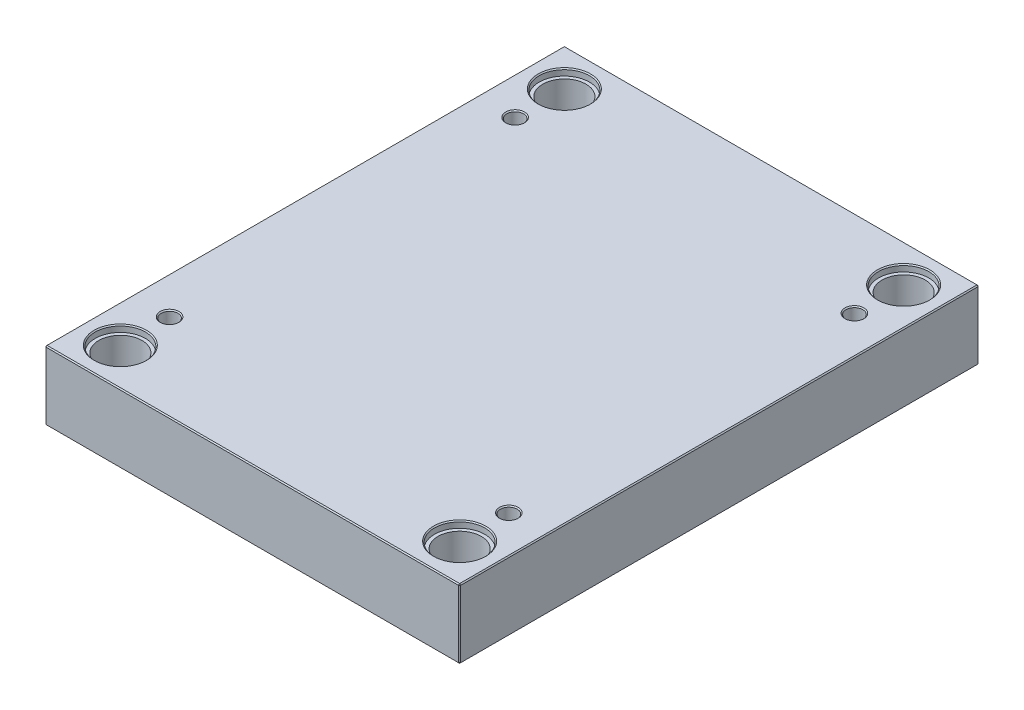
ISO-10303-21;
HEADER;
FILE_DESCRIPTION(('STEP AP214'),'2;1');
FILE_NAME('part.step','',(''),(''),'','','');
FILE_SCHEMA(('AUTOMOTIVE_DESIGN { 1 0 10303 214 1 1 1 1 }'));
ENDSEC;
DATA;
#1=APPLICATION_CONTEXT('core data for automotive mechanical design processes');
#2=APPLICATION_PROTOCOL_DEFINITION('international standard','automotive_design',2000,#1);
#3=PRODUCT_CONTEXT('',#1,'mechanical');
#4=PRODUCT('Part','Part','',(#3));
#5=PRODUCT_RELATED_PRODUCT_CATEGORY('part','',(#4));
#6=PRODUCT_DEFINITION_FORMATION('','',#4);
#7=PRODUCT_DEFINITION_CONTEXT('part definition',#1,'design');
#8=PRODUCT_DEFINITION('design','',#6,#7);
#9=PRODUCT_DEFINITION_SHAPE('','',#8);
#10=(LENGTH_UNIT() NAMED_UNIT(*) SI_UNIT(.MILLI.,.METRE.));
#11=(NAMED_UNIT(*) PLANE_ANGLE_UNIT() SI_UNIT($,.RADIAN.));
#12=(NAMED_UNIT(*) SI_UNIT($,.STERADIAN.) SOLID_ANGLE_UNIT());
#13=UNCERTAINTY_MEASURE_WITH_UNIT(LENGTH_MEASURE(1.E-05),#10,'distance_accuracy_value','');
#14=(GEOMETRIC_REPRESENTATION_CONTEXT(3) GLOBAL_UNCERTAINTY_ASSIGNED_CONTEXT((#13)) GLOBAL_UNIT_ASSIGNED_CONTEXT((#10,
#11,#12)) REPRESENTATION_CONTEXT('',''));
#15=CARTESIAN_POINT('',(0.,0.,0.));
#16=DIRECTION('',(0.,0.,1.));
#17=DIRECTION('',(1.,0.,0.));
#18=AXIS2_PLACEMENT_3D('',#15,#16,#17);
#19=CARTESIAN_POINT('',(-162.,0.,-212.));
#20=DIRECTION('',(0.,1.,0.));
#21=DIRECTION('',(0.,0.,1.));
#22=AXIS2_PLACEMENT_3D('',#19,#20,#21);
#23=CYLINDRICAL_SURFACE('',#22,20.65);
#24=CARTESIAN_POINT('',(-162.,0.999999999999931,-212.));
#25=DIRECTION('',(0.,1.,0.));
#26=DIRECTION('',(0.,0.,1.));
#27=AXIS2_PLACEMENT_3D('',#24,#25,#26);
#28=CIRCLE('',#27,20.65);
#29=CARTESIAN_POINT('',(-162.,0.999999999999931,-191.35));
#30=VERTEX_POINT('',#29);
#31=EDGE_CURVE('E471',#30,#30,#28,.F.);
#32=ORIENTED_EDGE('',*,*,#31,.T.);
#33=EDGE_LOOP('',(#32));
#34=FACE_BOUND('',#33,.T.);
#35=CARTESIAN_POINT('',(-162.,59.7,-212.));
#36=DIRECTION('',(0.,1.,0.));
#37=DIRECTION('',(0.,0.,1.));
#38=AXIS2_PLACEMENT_3D('',#35,#36,#37);
#39=CIRCLE('',#38,20.65);
#40=CARTESIAN_POINT('',(-162.,59.7,-191.35));
#41=VERTEX_POINT('',#40);
#42=EDGE_CURVE('E220',#41,#41,#39,.F.);
#43=ORIENTED_EDGE('',*,*,#42,.F.);
#44=EDGE_LOOP('',(#43));
#45=FACE_BOUND('',#44,.T.);
#46=ADVANCED_FACE('F15',(#34,#45),#23,.F.);
#47=CARTESIAN_POINT('',(162.,0.,-212.));
#48=DIRECTION('',(0.,1.,0.));
#49=DIRECTION('',(0.,0.,1.));
#50=AXIS2_PLACEMENT_3D('',#47,#48,#49);
#51=CYLINDRICAL_SURFACE('',#50,20.65);
#52=CARTESIAN_POINT('',(162.,0.999999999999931,-212.));
#53=DIRECTION('',(0.,1.,0.));
#54=DIRECTION('',(0.,0.,1.));
#55=AXIS2_PLACEMENT_3D('',#52,#53,#54);
#56=CIRCLE('',#55,20.65);
#57=CARTESIAN_POINT('',(162.,0.999999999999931,-191.35));
#58=VERTEX_POINT('',#57);
#59=EDGE_CURVE('E473',#58,#58,#56,.F.);
#60=ORIENTED_EDGE('',*,*,#59,.T.);
#61=EDGE_LOOP('',(#60));
#62=FACE_BOUND('',#61,.T.);
#63=CARTESIAN_POINT('',(162.,59.7,-212.));
#64=DIRECTION('',(0.,1.,0.));
#65=DIRECTION('',(0.,0.,1.));
#66=AXIS2_PLACEMENT_3D('',#63,#64,#65);
#67=CIRCLE('',#66,20.65);
#68=CARTESIAN_POINT('',(162.,59.7,-191.35));
#69=VERTEX_POINT('',#68);
#70=EDGE_CURVE('E217',#69,#69,#67,.F.);
#71=ORIENTED_EDGE('',*,*,#70,.F.);
#72=EDGE_LOOP('',(#71));
#73=FACE_BOUND('',#72,.T.);
#74=ADVANCED_FACE('F262',(#62,#73),#51,.F.);
#75=CARTESIAN_POINT('',(162.,0.,212.));
#76=DIRECTION('',(0.,1.,0.));
#77=DIRECTION('',(0.,0.,1.));
#78=AXIS2_PLACEMENT_3D('',#75,#76,#77);
#79=CYLINDRICAL_SURFACE('',#78,20.65);
#80=CARTESIAN_POINT('',(162.,1.0000000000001,212.));
#81=DIRECTION('',(0.,1.,0.));
#82=DIRECTION('',(0.,0.,1.));
#83=AXIS2_PLACEMENT_3D('',#80,#81,#82);
#84=CIRCLE('',#83,20.65);
#85=CARTESIAN_POINT('',(162.,1.0000000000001,232.65));
#86=VERTEX_POINT('',#85);
#87=EDGE_CURVE('E476',#86,#86,#84,.F.);
#88=ORIENTED_EDGE('',*,*,#87,.T.);
#89=EDGE_LOOP('',(#88));
#90=FACE_BOUND('',#89,.T.);
#91=CARTESIAN_POINT('',(162.,59.7,212.));
#92=DIRECTION('',(0.,1.,0.));
#93=DIRECTION('',(0.,0.,1.));
#94=AXIS2_PLACEMENT_3D('',#91,#92,#93);
#95=CIRCLE('',#94,20.65);
#96=CARTESIAN_POINT('',(162.,59.7,232.65));
#97=VERTEX_POINT('',#96);
#98=EDGE_CURVE('E213',#97,#97,#95,.F.);
#99=ORIENTED_EDGE('',*,*,#98,.F.);
#100=EDGE_LOOP('',(#99));
#101=FACE_BOUND('',#100,.T.);
#102=ADVANCED_FACE('F269',(#90,#101),#79,.F.);
#103=CARTESIAN_POINT('',(-162.,0.,212.));
#104=DIRECTION('',(0.,1.,0.));
#105=DIRECTION('',(0.,0.,1.));
#106=AXIS2_PLACEMENT_3D('',#103,#104,#105);
#107=CYLINDRICAL_SURFACE('',#106,20.65);
#108=CARTESIAN_POINT('',(-162.,0.999999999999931,212.));
#109=DIRECTION('',(0.,1.,0.));
#110=DIRECTION('',(0.,0.,1.));
#111=AXIS2_PLACEMENT_3D('',#108,#109,#110);
#112=CIRCLE('',#111,20.65);
#113=CARTESIAN_POINT('',(-162.,0.999999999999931,232.65));
#114=VERTEX_POINT('',#113);
#115=EDGE_CURVE('E479',#114,#114,#112,.F.);
#116=ORIENTED_EDGE('',*,*,#115,.T.);
#117=EDGE_LOOP('',(#116));
#118=FACE_BOUND('',#117,.T.);
#119=CARTESIAN_POINT('',(-162.,59.7,212.));
#120=DIRECTION('',(0.,1.,0.));
#121=DIRECTION('',(0.,0.,1.));
#122=AXIS2_PLACEMENT_3D('',#119,#120,#121);
#123=CIRCLE('',#122,20.65);
#124=CARTESIAN_POINT('',(-162.,59.7,232.65));
#125=VERTEX_POINT('',#124);
#126=EDGE_CURVE('E210',#125,#125,#123,.F.);
#127=ORIENTED_EDGE('',*,*,#126,.F.);
#128=EDGE_LOOP('',(#127));
#129=FACE_BOUND('',#128,.T.);
#130=ADVANCED_FACE('F276',(#118,#129),#107,.F.);
#131=CARTESIAN_POINT('',(-198.,66.,248.));
#132=DIRECTION('',(1.,0.,0.));
#133=DIRECTION('',(0.,0.,-1.));
#134=AXIS2_PLACEMENT_3D('',#131,#132,#133);
#135=PLANE('',#134);
#136=DIRECTION('',(0.,-1.,0.));
#137=VECTOR('',#136,1.);
#138=CARTESIAN_POINT('',(-198.,66.,-247.));
#139=LINE('',#138,#137);
#140=CARTESIAN_POINT('',(-198.,65.,-247.));
#141=VERTEX_POINT('',#140);
#142=CARTESIAN_POINT('',(-198.,1.00000000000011,-247.));
#143=VERTEX_POINT('',#142);
#144=EDGE_CURVE('E486',#141,#143,#139,.T.);
#145=ORIENTED_EDGE('',*,*,#144,.T.);
#146=DIRECTION('',(0.,0.,1.));
#147=VECTOR('',#146,1.);
#148=CARTESIAN_POINT('',(-198.,1.00000000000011,248.));
#149=LINE('',#148,#147);
#150=CARTESIAN_POINT('',(-198.,1.00000000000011,247.));
#151=VERTEX_POINT('',#150);
#152=EDGE_CURVE('E489',#143,#151,#149,.T.);
#153=ORIENTED_EDGE('',*,*,#152,.T.);
#154=DIRECTION('',(0.,1.,0.));
#155=VECTOR('',#154,1.);
#156=CARTESIAN_POINT('',(-198.,66.,247.));
#157=LINE('',#156,#155);
#158=CARTESIAN_POINT('',(-198.,65.,247.));
#159=VERTEX_POINT('',#158);
#160=EDGE_CURVE('E484',#151,#159,#157,.T.);
#161=ORIENTED_EDGE('',*,*,#160,.T.);
#162=DIRECTION('',(0.,0.,-1.));
#163=VECTOR('',#162,1.);
#164=CARTESIAN_POINT('',(-198.,65.,-248.));
#165=LINE('',#164,#163);
#166=EDGE_CURVE('E482',#159,#141,#165,.T.);
#167=ORIENTED_EDGE('',*,*,#166,.T.);
#168=EDGE_LOOP('',(#145,#153,#161,#167));
#169=FACE_BOUND('',#168,.T.);
#170=ADVANCED_FACE('F297',(#169),#135,.F.);
#171=CARTESIAN_POINT('',(198.,66.,248.));
#172=DIRECTION('',(0.,0.,-1.));
#173=DIRECTION('',(-1.,0.,0.));
#174=AXIS2_PLACEMENT_3D('',#171,#172,#173);
#175=PLANE('',#174);
#176=DIRECTION('',(-1.,0.,0.));
#177=VECTOR('',#176,1.);
#178=CARTESIAN_POINT('',(-198.,65.,248.));
#179=LINE('',#178,#177);
#180=CARTESIAN_POINT('',(197.,65.,248.));
#181=VERTEX_POINT('',#180);
#182=CARTESIAN_POINT('',(-197.,65.,248.));
#183=VERTEX_POINT('',#182);
#184=EDGE_CURVE('E508',#181,#183,#179,.T.);
#185=ORIENTED_EDGE('',*,*,#184,.T.);
#186=DIRECTION('',(0.,-1.,0.));
#187=VECTOR('',#186,1.);
#188=CARTESIAN_POINT('',(-197.,66.,248.));
#189=LINE('',#188,#187);
#190=CARTESIAN_POINT('',(-197.,1.00000000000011,248.));
#191=VERTEX_POINT('',#190);
#192=EDGE_CURVE('E514',#183,#191,#189,.T.);
#193=ORIENTED_EDGE('',*,*,#192,.T.);
#194=DIRECTION('',(1.,0.,0.));
#195=VECTOR('',#194,1.);
#196=CARTESIAN_POINT('',(198.,1.00000000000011,248.));
#197=LINE('',#196,#195);
#198=CARTESIAN_POINT('',(197.,1.00000000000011,248.));
#199=VERTEX_POINT('',#198);
#200=EDGE_CURVE('E512',#191,#199,#197,.T.);
#201=ORIENTED_EDGE('',*,*,#200,.T.);
#202=DIRECTION('',(0.,1.,0.));
#203=VECTOR('',#202,1.);
#204=CARTESIAN_POINT('',(197.,66.,248.));
#205=LINE('',#204,#203);
#206=EDGE_CURVE('E510',#199,#181,#205,.T.);
#207=ORIENTED_EDGE('',*,*,#206,.T.);
#208=EDGE_LOOP('',(#185,#193,#201,#207));
#209=FACE_BOUND('',#208,.T.);
#210=ADVANCED_FACE('F293',(#209),#175,.F.);
#211=CARTESIAN_POINT('',(198.,66.,248.));
#212=DIRECTION('',(-1.,0.,0.));
#213=DIRECTION('',(0.,0.,1.));
#214=AXIS2_PLACEMENT_3D('',#211,#212,#213);
#215=PLANE('',#214);
#216=DIRECTION('',(0.,0.,-1.));
#217=VECTOR('',#216,1.);
#218=CARTESIAN_POINT('',(198.,1.00000000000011,248.));
#219=LINE('',#218,#217);
#220=CARTESIAN_POINT('',(198.,1.00000000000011,247.));
#221=VERTEX_POINT('',#220);
#222=CARTESIAN_POINT('',(198.,1.00000000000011,-247.));
#223=VERTEX_POINT('',#222);
#224=EDGE_CURVE('E503',#221,#223,#219,.T.);
#225=ORIENTED_EDGE('',*,*,#224,.T.);
#226=DIRECTION('',(0.,1.,0.));
#227=VECTOR('',#226,1.);
#228=CARTESIAN_POINT('',(198.,66.,-247.));
#229=LINE('',#228,#227);
#230=CARTESIAN_POINT('',(198.,65.,-247.));
#231=VERTEX_POINT('',#230);
#232=EDGE_CURVE('E505',#223,#231,#229,.T.);
#233=ORIENTED_EDGE('',*,*,#232,.T.);
#234=DIRECTION('',(0.,0.,1.));
#235=VECTOR('',#234,1.);
#236=CARTESIAN_POINT('',(198.,65.,248.));
#237=LINE('',#236,#235);
#238=CARTESIAN_POINT('',(198.,65.,247.));
#239=VERTEX_POINT('',#238);
#240=EDGE_CURVE('E499',#231,#239,#237,.T.);
#241=ORIENTED_EDGE('',*,*,#240,.T.);
#242=DIRECTION('',(0.,-1.,0.));
#243=VECTOR('',#242,1.);
#244=CARTESIAN_POINT('',(198.,66.,247.));
#245=LINE('',#244,#243);
#246=EDGE_CURVE('E501',#239,#221,#245,.T.);
#247=ORIENTED_EDGE('',*,*,#246,.T.);
#248=EDGE_LOOP('',(#225,#233,#241,#247));
#249=FACE_BOUND('',#248,.T.);
#250=ADVANCED_FACE('F289',(#249),#215,.F.);
#251=CARTESIAN_POINT('',(198.,66.,-248.));
#252=DIRECTION('',(0.,0.,1.));
#253=DIRECTION('',(1.,0.,0.));
#254=AXIS2_PLACEMENT_3D('',#251,#252,#253);
#255=PLANE('',#254);
#256=DIRECTION('',(0.,-1.,0.));
#257=VECTOR('',#256,1.);
#258=CARTESIAN_POINT('',(197.,66.,-248.));
#259=LINE('',#258,#257);
#260=CARTESIAN_POINT('',(197.,65.,-248.));
#261=VERTEX_POINT('',#260);
#262=CARTESIAN_POINT('',(197.,1.00000000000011,-248.));
#263=VERTEX_POINT('',#262);
#264=EDGE_CURVE('E493',#261,#263,#259,.T.);
#265=ORIENTED_EDGE('',*,*,#264,.T.);
#266=DIRECTION('',(-1.,0.,0.));
#267=VECTOR('',#266,1.);
#268=CARTESIAN_POINT('',(198.,1.00000000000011,-248.));
#269=LINE('',#268,#267);
#270=CARTESIAN_POINT('',(-197.,1.00000000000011,-248.));
#271=VERTEX_POINT('',#270);
#272=EDGE_CURVE('E137',#263,#271,#269,.T.);
#273=ORIENTED_EDGE('',*,*,#272,.T.);
#274=DIRECTION('',(0.,1.,0.));
#275=VECTOR('',#274,1.);
#276=CARTESIAN_POINT('',(-197.,66.,-248.));
#277=LINE('',#276,#275);
#278=CARTESIAN_POINT('',(-197.,65.,-248.));
#279=VERTEX_POINT('',#278);
#280=EDGE_CURVE('E495',#271,#279,#277,.T.);
#281=ORIENTED_EDGE('',*,*,#280,.T.);
#282=DIRECTION('',(1.,0.,0.));
#283=VECTOR('',#282,1.);
#284=CARTESIAN_POINT('',(198.,65.,-248.));
#285=LINE('',#284,#283);
#286=EDGE_CURVE('E491',#279,#261,#285,.T.);
#287=ORIENTED_EDGE('',*,*,#286,.T.);
#288=EDGE_LOOP('',(#265,#273,#281,#287));
#289=FACE_BOUND('',#288,.T.);
#290=ADVANCED_FACE('F281',(#289),#255,.F.);
#291=CARTESIAN_POINT('',(0.,66.,0.));
#292=DIRECTION('',(0.,1.,0.));
#293=DIRECTION('',(0.,0.,1.));
#294=AXIS2_PLACEMENT_3D('',#291,#292,#293);
#295=PLANE('',#294);
#296=CARTESIAN_POINT('',(162.,66.,212.));
#297=DIRECTION('',(0.,1.,0.));
#298=DIRECTION('',(0.,0.,1.));
#299=AXIS2_PLACEMENT_3D('',#296,#297,#298);
#300=CIRCLE('',#299,25.);
#301=CARTESIAN_POINT('',(162.,66.,237.));
#302=VERTEX_POINT('',#301);
#303=EDGE_CURVE('E235',#302,#302,#300,.F.);
#304=ORIENTED_EDGE('',*,*,#303,.T.);
#305=EDGE_LOOP('',(#304));
#306=FACE_BOUND('',#305,.T.);
#307=CARTESIAN_POINT('',(-162.,66.,212.));
#308=DIRECTION('',(0.,1.,0.));
#309=DIRECTION('',(0.,0.,1.));
#310=AXIS2_PLACEMENT_3D('',#307,#308,#309);
#311=CIRCLE('',#310,25.);
#312=CARTESIAN_POINT('',(-162.,66.,237.));
#313=VERTEX_POINT('',#312);
#314=EDGE_CURVE('E232',#313,#313,#311,.F.);
#315=ORIENTED_EDGE('',*,*,#314,.T.);
#316=EDGE_LOOP('',(#315));
#317=FACE_BOUND('',#316,.T.);
#318=CARTESIAN_POINT('',(162.,66.,-212.));
#319=DIRECTION('',(0.,1.,0.));
#320=DIRECTION('',(0.,0.,1.));
#321=AXIS2_PLACEMENT_3D('',#318,#319,#320);
#322=CIRCLE('',#321,25.);
#323=CARTESIAN_POINT('',(162.,66.,-187.));
#324=VERTEX_POINT('',#323);
#325=EDGE_CURVE('E229',#324,#324,#322,.F.);
#326=ORIENTED_EDGE('',*,*,#325,.T.);
#327=EDGE_LOOP('',(#326));
#328=FACE_BOUND('',#327,.T.);
#329=CARTESIAN_POINT('',(-162.,66.,-212.));
#330=DIRECTION('',(0.,1.,0.));
#331=DIRECTION('',(0.,0.,1.));
#332=AXIS2_PLACEMENT_3D('',#329,#330,#331);
#333=CIRCLE('',#332,25.);
#334=CARTESIAN_POINT('',(-162.,66.,-187.));
#335=VERTEX_POINT('',#334);
#336=EDGE_CURVE('E226',#335,#335,#333,.F.);
#337=ORIENTED_EDGE('',*,*,#336,.T.);
#338=EDGE_LOOP('',(#337));
#339=FACE_BOUND('',#338,.T.);
#340=CARTESIAN_POINT('',(-162.,66.,165.));
#341=DIRECTION('',(0.,1.,0.));
#342=DIRECTION('',(0.,0.,1.));
#343=AXIS2_PLACEMENT_3D('',#340,#341,#342);
#344=CIRCLE('',#343,9.00000000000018);
#345=CARTESIAN_POINT('',(-162.,66.,174.));
#346=VERTEX_POINT('',#345);
#347=EDGE_CURVE('E197',#346,#346,#344,.F.);
#348=ORIENTED_EDGE('',*,*,#347,.T.);
#349=EDGE_LOOP('',(#348));
#350=FACE_BOUND('',#349,.T.);
#351=CARTESIAN_POINT('',(162.,66.,165.));
#352=DIRECTION('',(0.,1.,0.));
#353=DIRECTION('',(0.,0.,1.));
#354=AXIS2_PLACEMENT_3D('',#351,#352,#353);
#355=CIRCLE('',#354,9.);
#356=CARTESIAN_POINT('',(162.,66.,174.));
#357=VERTEX_POINT('',#356);
#358=EDGE_CURVE('E194',#357,#357,#355,.F.);
#359=ORIENTED_EDGE('',*,*,#358,.T.);
#360=EDGE_LOOP('',(#359));
#361=FACE_BOUND('',#360,.T.);
#362=CARTESIAN_POINT('',(162.,66.,-165.));
#363=DIRECTION('',(0.,1.,0.));
#364=DIRECTION('',(0.,0.,1.));
#365=AXIS2_PLACEMENT_3D('',#362,#363,#364);
#366=CIRCLE('',#365,9.00000000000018);
#367=CARTESIAN_POINT('',(162.,66.,-156.));
#368=VERTEX_POINT('',#367);
#369=EDGE_CURVE('E191',#368,#368,#366,.F.);
#370=ORIENTED_EDGE('',*,*,#369,.T.);
#371=EDGE_LOOP('',(#370));
#372=FACE_BOUND('',#371,.T.);
#373=CARTESIAN_POINT('',(-162.,66.,-165.));
#374=DIRECTION('',(0.,1.,0.));
#375=DIRECTION('',(0.,0.,1.));
#376=AXIS2_PLACEMENT_3D('',#373,#374,#375);
#377=CIRCLE('',#376,9.);
#378=CARTESIAN_POINT('',(-162.,66.,-156.));
#379=VERTEX_POINT('',#378);
#380=EDGE_CURVE('E187',#379,#379,#377,.F.);
#381=ORIENTED_EDGE('',*,*,#380,.T.);
#382=EDGE_LOOP('',(#381));
#383=FACE_BOUND('',#382,.T.);
#384=DIRECTION('',(0.,0.,-1.));
#385=VECTOR('',#384,1.);
#386=CARTESIAN_POINT('',(197.,66.,-248.));
#387=LINE('',#386,#385);
#388=CARTESIAN_POINT('',(197.,66.,247.));
#389=VERTEX_POINT('',#388);
#390=CARTESIAN_POINT('',(197.,66.,-247.));
#391=VERTEX_POINT('',#390);
#392=EDGE_CURVE('E30',#389,#391,#387,.T.);
#393=ORIENTED_EDGE('',*,*,#392,.T.);
#394=DIRECTION('',(-1.,0.,0.));
#395=VECTOR('',#394,1.);
#396=CARTESIAN_POINT('',(-198.,66.,-247.));
#397=LINE('',#396,#395);
#398=CARTESIAN_POINT('',(-197.,66.,-247.));
#399=VERTEX_POINT('',#398);
#400=EDGE_CURVE('E188',#391,#399,#397,.T.);
#401=ORIENTED_EDGE('',*,*,#400,.T.);
#402=DIRECTION('',(0.,0.,1.));
#403=VECTOR('',#402,1.);
#404=CARTESIAN_POINT('',(-197.,66.,248.));
#405=LINE('',#404,#403);
#406=CARTESIAN_POINT('',(-197.,66.,247.));
#407=VERTEX_POINT('',#406);
#408=EDGE_CURVE('E517',#399,#407,#405,.T.);
#409=ORIENTED_EDGE('',*,*,#408,.T.);
#410=DIRECTION('',(1.,0.,0.));
#411=VECTOR('',#410,1.);
#412=CARTESIAN_POINT('',(198.,66.,247.));
#413=LINE('',#412,#411);
#414=EDGE_CURVE('E35',#407,#389,#413,.T.);
#415=ORIENTED_EDGE('',*,*,#414,.T.);
#416=EDGE_LOOP('',(#393,#401,#409,#415));
#417=FACE_BOUND('',#416,.T.);
#418=ADVANCED_FACE('F278',(#306,#317,#328,#339,#350,#361,#372,#383,#417),#295,.T.);
#419=CARTESIAN_POINT('',(0.,0.,0.));
#420=DIRECTION('',(0.,1.,0.));
#421=DIRECTION('',(0.,0.,1.));
#422=AXIS2_PLACEMENT_3D('',#419,#420,#421);
#423=PLANE('',#422);
#424=CARTESIAN_POINT('',(-162.,0.,-212.));
#425=DIRECTION('',(0.,1.,0.));
#426=DIRECTION('',(0.,0.,1.));
#427=AXIS2_PLACEMENT_3D('',#424,#425,#426);
#428=CIRCLE('',#427,21.65);
#429=CARTESIAN_POINT('',(-162.,0.,-190.35));
#430=VERTEX_POINT('',#429);
#431=EDGE_CURVE('E468',#430,#430,#428,.T.);
#432=ORIENTED_EDGE('',*,*,#431,.T.);
#433=EDGE_LOOP('',(#432));
#434=FACE_BOUND('',#433,.T.);
#435=CARTESIAN_POINT('',(162.,0.,-212.));
#436=DIRECTION('',(0.,1.,0.));
#437=DIRECTION('',(0.,0.,1.));
#438=AXIS2_PLACEMENT_3D('',#435,#436,#437);
#439=CIRCLE('',#438,21.65);
#440=CARTESIAN_POINT('',(162.,0.,-190.35));
#441=VERTEX_POINT('',#440);
#442=EDGE_CURVE('E465',#441,#441,#439,.T.);
#443=ORIENTED_EDGE('',*,*,#442,.T.);
#444=EDGE_LOOP('',(#443));
#445=FACE_BOUND('',#444,.T.);
#446=CARTESIAN_POINT('',(162.,0.,212.));
#447=DIRECTION('',(0.,1.,0.));
#448=DIRECTION('',(0.,0.,1.));
#449=AXIS2_PLACEMENT_3D('',#446,#447,#448);
#450=CIRCLE('',#449,21.65);
#451=CARTESIAN_POINT('',(162.,0.,233.65));
#452=VERTEX_POINT('',#451);
#453=EDGE_CURVE('E462',#452,#452,#450,.T.);
#454=ORIENTED_EDGE('',*,*,#453,.T.);
#455=EDGE_LOOP('',(#454));
#456=FACE_BOUND('',#455,.T.);
#457=CARTESIAN_POINT('',(-162.,0.,212.));
#458=DIRECTION('',(0.,1.,0.));
#459=DIRECTION('',(0.,0.,1.));
#460=AXIS2_PLACEMENT_3D('',#457,#458,#459);
#461=CIRCLE('',#460,21.65);
#462=CARTESIAN_POINT('',(-162.,0.,233.65));
#463=VERTEX_POINT('',#462);
#464=EDGE_CURVE('E459',#463,#463,#461,.T.);
#465=ORIENTED_EDGE('',*,*,#464,.T.);
#466=EDGE_LOOP('',(#465));
#467=FACE_BOUND('',#466,.T.);
#468=DIRECTION('',(0.,0.,1.));
#469=VECTOR('',#468,1.);
#470=CARTESIAN_POINT('',(197.,0.,0.));
#471=LINE('',#470,#469);
#472=CARTESIAN_POINT('',(197.,0.,-247.));
#473=VERTEX_POINT('',#472);
#474=CARTESIAN_POINT('',(197.,0.,247.));
#475=VERTEX_POINT('',#474);
#476=EDGE_CURVE('E107',#473,#475,#471,.T.);
#477=ORIENTED_EDGE('',*,*,#476,.T.);
#478=DIRECTION('',(-1.,0.,0.));
#479=VECTOR('',#478,1.);
#480=CARTESIAN_POINT('',(0.,0.,247.));
#481=LINE('',#480,#479);
#482=CARTESIAN_POINT('',(-197.,0.,247.));
#483=VERTEX_POINT('',#482);
#484=EDGE_CURVE('E457',#475,#483,#481,.T.);
#485=ORIENTED_EDGE('',*,*,#484,.T.);
#486=DIRECTION('',(0.,0.,-1.));
#487=VECTOR('',#486,1.);
#488=CARTESIAN_POINT('',(-197.,0.,0.));
#489=LINE('',#488,#487);
#490=CARTESIAN_POINT('',(-197.,0.,-247.));
#491=VERTEX_POINT('',#490);
#492=EDGE_CURVE('E109',#483,#491,#489,.T.);
#493=ORIENTED_EDGE('',*,*,#492,.T.);
#494=DIRECTION('',(1.,0.,0.));
#495=VECTOR('',#494,1.);
#496=CARTESIAN_POINT('',(0.,0.,-247.));
#497=LINE('',#496,#495);
#498=EDGE_CURVE('E103',#491,#473,#497,.T.);
#499=ORIENTED_EDGE('',*,*,#498,.T.);
#500=EDGE_LOOP('',(#477,#485,#493,#499));
#501=FACE_BOUND('',#500,.T.);
#502=ADVANCED_FACE('F105',(#434,#445,#456,#467,#501),#423,.F.);
#503=CARTESIAN_POINT('',(-162.,0.,-212.));
#504=DIRECTION('',(0.,-1.,0.));
#505=DIRECTION('',(0.,0.,-1.));
#506=AXIS2_PLACEMENT_3D('',#503,#504,#505);
#507=CONICAL_SURFACE('',#506,21.65,0.785398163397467);
#508=ORIENTED_EDGE('',*,*,#31,.F.);
#509=EDGE_LOOP('',(#508));
#510=FACE_BOUND('',#509,.T.);
#511=ORIENTED_EDGE('',*,*,#431,.F.);
#512=EDGE_LOOP('',(#511));
#513=FACE_BOUND('',#512,.T.);
#514=ADVANCED_FACE('F285',(#510,#513),#507,.F.);
#515=CARTESIAN_POINT('',(162.,0.,-212.));
#516=DIRECTION('',(0.,-1.,0.));
#517=DIRECTION('',(0.,0.,-1.));
#518=AXIS2_PLACEMENT_3D('',#515,#516,#517);
#519=CONICAL_SURFACE('',#518,21.65,0.785398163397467);
#520=ORIENTED_EDGE('',*,*,#59,.F.);
#521=EDGE_LOOP('',(#520));
#522=FACE_BOUND('',#521,.T.);
#523=ORIENTED_EDGE('',*,*,#442,.F.);
#524=EDGE_LOOP('',(#523));
#525=FACE_BOUND('',#524,.T.);
#526=ADVANCED_FACE('F304',(#522,#525),#519,.F.);
#527=CARTESIAN_POINT('',(162.,0.,212.));
#528=DIRECTION('',(0.,-1.,0.));
#529=DIRECTION('',(0.,0.,-1.));
#530=AXIS2_PLACEMENT_3D('',#527,#528,#529);
#531=CONICAL_SURFACE('',#530,21.65,0.785398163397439);
#532=ORIENTED_EDGE('',*,*,#87,.F.);
#533=EDGE_LOOP('',(#532));
#534=FACE_BOUND('',#533,.T.);
#535=ORIENTED_EDGE('',*,*,#453,.F.);
#536=EDGE_LOOP('',(#535));
#537=FACE_BOUND('',#536,.T.);
#538=ADVANCED_FACE('F308',(#534,#537),#531,.F.);
#539=CARTESIAN_POINT('',(-162.,0.,212.));
#540=DIRECTION('',(0.,-1.,0.));
#541=DIRECTION('',(0.,0.,-1.));
#542=AXIS2_PLACEMENT_3D('',#539,#540,#541);
#543=CONICAL_SURFACE('',#542,21.65,0.785398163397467);
#544=ORIENTED_EDGE('',*,*,#115,.F.);
#545=EDGE_LOOP('',(#544));
#546=FACE_BOUND('',#545,.T.);
#547=ORIENTED_EDGE('',*,*,#464,.F.);
#548=EDGE_LOOP('',(#547));
#549=FACE_BOUND('',#548,.T.);
#550=ADVANCED_FACE('F312',(#546,#549),#543,.F.);
#551=CARTESIAN_POINT('',(198.,66.,247.));
#552=DIRECTION('',(-0.707106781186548,0.,-0.707106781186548));
#553=DIRECTION('',(0.,-1.,0.));
#554=AXIS2_PLACEMENT_3D('',#551,#552,#553);
#555=PLANE('',#554);
#556=DIRECTION('',(-0.707106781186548,0.,0.707106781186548));
#557=VECTOR('',#556,1.);
#558=CARTESIAN_POINT('',(197.,65.,248.));
#559=LINE('',#558,#557);
#560=EDGE_CURVE('E125',#181,#239,#559,.F.);
#561=ORIENTED_EDGE('',*,*,#560,.F.);
#562=ORIENTED_EDGE('',*,*,#206,.F.);
#563=DIRECTION('',(0.707106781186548,0.,-0.707106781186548));
#564=VECTOR('',#563,1.);
#565=CARTESIAN_POINT('',(197.,1.00000000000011,248.));
#566=LINE('',#565,#564);
#567=EDGE_CURVE('E179',#221,#199,#566,.F.);
#568=ORIENTED_EDGE('',*,*,#567,.F.);
#569=ORIENTED_EDGE('',*,*,#246,.F.);
#570=EDGE_LOOP('',(#561,#562,#568,#569));
#571=FACE_BOUND('',#570,.T.);
#572=ADVANCED_FACE('F316',(#571),#555,.F.);
#573=CARTESIAN_POINT('',(197.,65.,248.));
#574=DIRECTION('',(0.577350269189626,0.577350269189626,0.577350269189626));
#575=DIRECTION('',(0.707106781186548,0.,-0.707106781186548));
#576=AXIS2_PLACEMENT_3D('',#573,#574,#575);
#577=PLANE('',#576);
#578=DIRECTION('',(0.,-0.707106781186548,0.707106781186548));
#579=VECTOR('',#578,1.);
#580=CARTESIAN_POINT('',(197.,65.,248.));
#581=LINE('',#580,#579);
#582=EDGE_CURVE('E174',#181,#389,#581,.F.);
#583=ORIENTED_EDGE('',*,*,#582,.F.);
#584=ORIENTED_EDGE('',*,*,#560,.T.);
#585=DIRECTION('',(-0.707106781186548,0.707106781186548,0.));
#586=VECTOR('',#585,1.);
#587=CARTESIAN_POINT('',(197.5,65.5,247.));
#588=LINE('',#587,#586);
#589=EDGE_CURVE('E176',#389,#239,#588,.F.);
#590=ORIENTED_EDGE('',*,*,#589,.F.);
#591=EDGE_LOOP('',(#583,#584,#590));
#592=FACE_BOUND('',#591,.T.);
#593=ADVANCED_FACE('F384',(#592),#577,.T.);
#594=CARTESIAN_POINT('',(197.,1.00000000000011,248.));
#595=DIRECTION('',(0.577350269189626,-0.577350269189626,0.577350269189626));
#596=DIRECTION('',(0.707106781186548,0.,-0.707106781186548));
#597=AXIS2_PLACEMENT_3D('',#594,#595,#596);
#598=PLANE('',#597);
#599=DIRECTION('',(-0.707106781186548,-0.707106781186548,0.));
#600=VECTOR('',#599,1.);
#601=CARTESIAN_POINT('',(197.5,0.500000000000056,247.));
#602=LINE('',#601,#600);
#603=EDGE_CURVE('E123',#221,#475,#602,.T.);
#604=ORIENTED_EDGE('',*,*,#603,.F.);
#605=ORIENTED_EDGE('',*,*,#567,.T.);
#606=DIRECTION('',(0.,0.707106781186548,0.707106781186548));
#607=VECTOR('',#606,1.);
#608=CARTESIAN_POINT('',(197.,1.00000000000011,248.));
#609=LINE('',#608,#607);
#610=EDGE_CURVE('E171',#475,#199,#609,.T.);
#611=ORIENTED_EDGE('',*,*,#610,.F.);
#612=EDGE_LOOP('',(#604,#605,#611));
#613=FACE_BOUND('',#612,.T.);
#614=ADVANCED_FACE('F380',(#613),#598,.T.);
#615=CARTESIAN_POINT('',(197.,66.,0.));
#616=DIRECTION('',(0.707106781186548,0.707106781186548,0.));
#617=DIRECTION('',(0.,0.,1.));
#618=AXIS2_PLACEMENT_3D('',#615,#616,#617);
#619=PLANE('',#618);
#620=ORIENTED_EDGE('',*,*,#589,.T.);
#621=ORIENTED_EDGE('',*,*,#240,.F.);
#622=DIRECTION('',(0.707106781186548,-0.707106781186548,0.));
#623=VECTOR('',#622,1.);
#624=CARTESIAN_POINT('',(198.,65.,-247.));
#625=LINE('',#624,#623);
#626=EDGE_CURVE('E165',#391,#231,#625,.T.);
#627=ORIENTED_EDGE('',*,*,#626,.F.);
#628=ORIENTED_EDGE('',*,*,#392,.F.);
#629=EDGE_LOOP('',(#620,#621,#627,#628));
#630=FACE_BOUND('',#629,.T.);
#631=ADVANCED_FACE('F376',(#630),#619,.T.);
#632=CARTESIAN_POINT('',(0.,66.,247.));
#633=DIRECTION('',(0.,0.707106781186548,0.707106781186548));
#634=DIRECTION('',(-1.,0.,0.));
#635=AXIS2_PLACEMENT_3D('',#632,#633,#634);
#636=PLANE('',#635);
#637=ORIENTED_EDGE('',*,*,#582,.T.);
#638=ORIENTED_EDGE('',*,*,#414,.F.);
#639=DIRECTION('',(0.,0.707106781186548,-0.707106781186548));
#640=VECTOR('',#639,1.);
#641=CARTESIAN_POINT('',(-197.,65.5,247.5));
#642=LINE('',#641,#640);
#643=EDGE_CURVE('E162',#183,#407,#642,.T.);
#644=ORIENTED_EDGE('',*,*,#643,.F.);
#645=ORIENTED_EDGE('',*,*,#184,.F.);
#646=EDGE_LOOP('',(#637,#638,#644,#645));
#647=FACE_BOUND('',#646,.T.);
#648=ADVANCED_FACE('F372',(#647),#636,.T.);
#649=CARTESIAN_POINT('',(-197.,66.,248.));
#650=DIRECTION('',(0.707106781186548,0.,-0.707106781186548));
#651=DIRECTION('',(0.,-1.,0.));
#652=AXIS2_PLACEMENT_3D('',#649,#650,#651);
#653=PLANE('',#652);
#654=DIRECTION('',(0.707106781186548,0.,0.707106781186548));
#655=VECTOR('',#654,1.);
#656=CARTESIAN_POINT('',(-197.,1.00000000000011,248.));
#657=LINE('',#656,#655);
#658=EDGE_CURVE('E156',#191,#151,#657,.F.);
#659=ORIENTED_EDGE('',*,*,#658,.F.);
#660=ORIENTED_EDGE('',*,*,#192,.F.);
#661=DIRECTION('',(-0.707106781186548,0.,-0.707106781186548));
#662=VECTOR('',#661,1.);
#663=CARTESIAN_POINT('',(-198.,65.,247.));
#664=LINE('',#663,#662);
#665=EDGE_CURVE('E159',#159,#183,#664,.F.);
#666=ORIENTED_EDGE('',*,*,#665,.F.);
#667=ORIENTED_EDGE('',*,*,#160,.F.);
#668=EDGE_LOOP('',(#659,#660,#666,#667));
#669=FACE_BOUND('',#668,.T.);
#670=ADVANCED_FACE('F368',(#669),#653,.F.);
#671=CARTESIAN_POINT('',(198.,1.00000000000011,248.));
#672=DIRECTION('',(0.,0.707106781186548,-0.707106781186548));
#673=DIRECTION('',(1.,0.,0.));
#674=AXIS2_PLACEMENT_3D('',#671,#672,#673);
#675=PLANE('',#674);
#676=ORIENTED_EDGE('',*,*,#610,.T.);
#677=ORIENTED_EDGE('',*,*,#200,.F.);
#678=DIRECTION('',(0.,-0.707106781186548,-0.707106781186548));
#679=VECTOR('',#678,1.);
#680=CARTESIAN_POINT('',(-197.,1.00000000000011,248.));
#681=LINE('',#680,#679);
#682=EDGE_CURVE('E134',#483,#191,#681,.F.);
#683=ORIENTED_EDGE('',*,*,#682,.F.);
#684=ORIENTED_EDGE('',*,*,#484,.F.);
#685=EDGE_LOOP('',(#676,#677,#683,#684));
#686=FACE_BOUND('',#685,.T.);
#687=ADVANCED_FACE('F365',(#686),#675,.F.);
#688=CARTESIAN_POINT('',(198.,1.00000000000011,248.));
#689=DIRECTION('',(-0.707106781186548,0.707106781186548,0.));
#690=DIRECTION('',(0.,0.,-1.));
#691=AXIS2_PLACEMENT_3D('',#688,#689,#690);
#692=PLANE('',#691);
#693=ORIENTED_EDGE('',*,*,#603,.T.);
#694=ORIENTED_EDGE('',*,*,#476,.F.);
#695=DIRECTION('',(0.707106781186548,0.707106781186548,0.));
#696=VECTOR('',#695,1.);
#697=CARTESIAN_POINT('',(197.5,0.50000000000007,-247.));
#698=LINE('',#697,#696);
#699=EDGE_CURVE('E120',#223,#473,#698,.F.);
#700=ORIENTED_EDGE('',*,*,#699,.F.);
#701=ORIENTED_EDGE('',*,*,#224,.F.);
#702=EDGE_LOOP('',(#693,#694,#700,#701));
#703=FACE_BOUND('',#702,.T.);
#704=ADVANCED_FACE('F118',(#703),#692,.F.);
#705=CARTESIAN_POINT('',(197.,66.,-248.));
#706=DIRECTION('',(-0.707106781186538,0.,0.707106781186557));
#707=DIRECTION('',(0.,-1.,0.));
#708=AXIS2_PLACEMENT_3D('',#705,#706,#707);
#709=PLANE('',#708);
#710=DIRECTION('',(0.707106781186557,0.,0.707106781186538));
#711=VECTOR('',#710,1.);
#712=CARTESIAN_POINT('',(198.,65.,-247.));
#713=LINE('',#712,#711);
#714=EDGE_CURVE('E167',#231,#261,#713,.F.);
#715=ORIENTED_EDGE('',*,*,#714,.F.);
#716=ORIENTED_EDGE('',*,*,#232,.F.);
#717=DIRECTION('',(-0.707106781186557,0.,-0.707106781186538));
#718=VECTOR('',#717,1.);
#719=CARTESIAN_POINT('',(197.,1.00000000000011,-248.));
#720=LINE('',#719,#718);
#721=EDGE_CURVE('E133',#263,#223,#720,.F.);
#722=ORIENTED_EDGE('',*,*,#721,.F.);
#723=ORIENTED_EDGE('',*,*,#264,.F.);
#724=EDGE_LOOP('',(#715,#716,#722,#723));
#725=FACE_BOUND('',#724,.T.);
#726=ADVANCED_FACE('F358',(#725),#709,.F.);
#727=CARTESIAN_POINT('',(198.,65.,-247.));
#728=DIRECTION('',(0.577350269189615,0.577350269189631,-0.577350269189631));
#729=DIRECTION('',(0.,0.707106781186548,0.707106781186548));
#730=AXIS2_PLACEMENT_3D('',#727,#728,#729);
#731=PLANE('',#730);
#732=ORIENTED_EDGE('',*,*,#626,.T.);
#733=ORIENTED_EDGE('',*,*,#714,.T.);
#734=DIRECTION('',(0.,0.707106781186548,0.707106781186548));
#735=VECTOR('',#734,1.);
#736=CARTESIAN_POINT('',(197.,65.5,-247.5));
#737=LINE('',#736,#735);
#738=EDGE_CURVE('E151',#391,#261,#737,.F.);
#739=ORIENTED_EDGE('',*,*,#738,.F.);
#740=EDGE_LOOP('',(#732,#733,#739));
#741=FACE_BOUND('',#740,.T.);
#742=ADVANCED_FACE('F354',(#741),#731,.T.);
#743=CARTESIAN_POINT('',(-198.,65.,247.));
#744=DIRECTION('',(-0.577350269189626,0.577350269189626,0.577350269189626));
#745=DIRECTION('',(0.707106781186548,0.,0.707106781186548));
#746=AXIS2_PLACEMENT_3D('',#743,#744,#745);
#747=PLANE('',#746);
#748=ORIENTED_EDGE('',*,*,#665,.T.);
#749=ORIENTED_EDGE('',*,*,#643,.T.);
#750=DIRECTION('',(-0.707106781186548,-0.707106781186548,0.));
#751=VECTOR('',#750,1.);
#752=CARTESIAN_POINT('',(-198.,65.,247.));
#753=LINE('',#752,#751);
#754=EDGE_CURVE('E142',#159,#407,#753,.F.);
#755=ORIENTED_EDGE('',*,*,#754,.F.);
#756=EDGE_LOOP('',(#748,#749,#755));
#757=FACE_BOUND('',#756,.T.);
#758=ADVANCED_FACE('F350',(#757),#747,.T.);
#759=CARTESIAN_POINT('',(-197.,1.00000000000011,248.));
#760=DIRECTION('',(-0.577350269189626,-0.577350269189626,0.577350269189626));
#761=DIRECTION('',(0.707106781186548,0.,0.707106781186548));
#762=AXIS2_PLACEMENT_3D('',#759,#760,#761);
#763=PLANE('',#762);
#764=ORIENTED_EDGE('',*,*,#682,.T.);
#765=ORIENTED_EDGE('',*,*,#658,.T.);
#766=DIRECTION('',(-0.707106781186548,0.707106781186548,0.));
#767=VECTOR('',#766,1.);
#768=CARTESIAN_POINT('',(-197.5,0.500000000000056,247.));
#769=LINE('',#768,#767);
#770=EDGE_CURVE('E138',#483,#151,#769,.T.);
#771=ORIENTED_EDGE('',*,*,#770,.F.);
#772=EDGE_LOOP('',(#764,#765,#771));
#773=FACE_BOUND('',#772,.T.);
#774=ADVANCED_FACE('F347',(#773),#763,.T.);
#775=CARTESIAN_POINT('',(197.,1.00000000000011,-248.));
#776=DIRECTION('',(0.577350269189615,-0.577350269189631,-0.577350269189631));
#777=DIRECTION('',(0.,0.707106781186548,-0.707106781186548));
#778=AXIS2_PLACEMENT_3D('',#775,#776,#777);
#779=PLANE('',#778);
#780=ORIENTED_EDGE('',*,*,#721,.T.);
#781=ORIENTED_EDGE('',*,*,#699,.T.);
#782=DIRECTION('',(0.,-0.707106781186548,0.707106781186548));
#783=VECTOR('',#782,1.);
#784=CARTESIAN_POINT('',(197.,1.00000000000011,-248.));
#785=LINE('',#784,#783);
#786=EDGE_CURVE('E130',#263,#473,#785,.T.);
#787=ORIENTED_EDGE('',*,*,#786,.F.);
#788=EDGE_LOOP('',(#780,#781,#787));
#789=FACE_BOUND('',#788,.T.);
#790=ADVANCED_FACE('F129',(#789),#779,.T.);
#791=CARTESIAN_POINT('',(0.,66.,-247.));
#792=DIRECTION('',(0.,0.707106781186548,-0.707106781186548));
#793=DIRECTION('',(1.,0.,0.));
#794=AXIS2_PLACEMENT_3D('',#791,#792,#793);
#795=PLANE('',#794);
#796=ORIENTED_EDGE('',*,*,#738,.T.);
#797=ORIENTED_EDGE('',*,*,#286,.F.);
#798=DIRECTION('',(0.,-0.707106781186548,-0.707106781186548));
#799=VECTOR('',#798,1.);
#800=CARTESIAN_POINT('',(-197.,65.,-248.));
#801=LINE('',#800,#799);
#802=EDGE_CURVE('E139',#399,#279,#801,.T.);
#803=ORIENTED_EDGE('',*,*,#802,.F.);
#804=ORIENTED_EDGE('',*,*,#400,.F.);
#805=EDGE_LOOP('',(#796,#797,#803,#804));
#806=FACE_BOUND('',#805,.T.);
#807=ADVANCED_FACE('F340',(#806),#795,.T.);
#808=CARTESIAN_POINT('',(-197.,66.,0.));
#809=DIRECTION('',(-0.707106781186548,0.707106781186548,0.));
#810=DIRECTION('',(0.,0.,-1.));
#811=AXIS2_PLACEMENT_3D('',#808,#809,#810);
#812=PLANE('',#811);
#813=ORIENTED_EDGE('',*,*,#754,.T.);
#814=ORIENTED_EDGE('',*,*,#408,.F.);
#815=DIRECTION('',(0.707106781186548,0.707106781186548,0.));
#816=VECTOR('',#815,1.);
#817=CARTESIAN_POINT('',(-197.5,65.5,-247.));
#818=LINE('',#817,#816);
#819=EDGE_CURVE('E145',#141,#399,#818,.T.);
#820=ORIENTED_EDGE('',*,*,#819,.F.);
#821=ORIENTED_EDGE('',*,*,#166,.F.);
#822=EDGE_LOOP('',(#813,#814,#820,#821));
#823=FACE_BOUND('',#822,.T.);
#824=ADVANCED_FACE('F336',(#823),#812,.T.);
#825=CARTESIAN_POINT('',(-198.,1.00000000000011,248.));
#826=DIRECTION('',(0.707106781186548,0.707106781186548,0.));
#827=DIRECTION('',(0.,0.,1.));
#828=AXIS2_PLACEMENT_3D('',#825,#826,#827);
#829=PLANE('',#828);
#830=ORIENTED_EDGE('',*,*,#770,.T.);
#831=ORIENTED_EDGE('',*,*,#152,.F.);
#832=DIRECTION('',(0.707106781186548,-0.707106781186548,0.));
#833=VECTOR('',#832,1.);
#834=CARTESIAN_POINT('',(-198.,1.00000000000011,-247.));
#835=LINE('',#834,#833);
#836=EDGE_CURVE('E528',#491,#143,#835,.F.);
#837=ORIENTED_EDGE('',*,*,#836,.F.);
#838=ORIENTED_EDGE('',*,*,#492,.F.);
#839=EDGE_LOOP('',(#830,#831,#837,#838));
#840=FACE_BOUND('',#839,.T.);
#841=ADVANCED_FACE('F333',(#840),#829,.F.);
#842=CARTESIAN_POINT('',(198.,1.00000000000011,-248.));
#843=DIRECTION('',(0.,0.707106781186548,0.707106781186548));
#844=DIRECTION('',(-1.,0.,0.));
#845=AXIS2_PLACEMENT_3D('',#842,#843,#844);
#846=PLANE('',#845);
#847=ORIENTED_EDGE('',*,*,#786,.T.);
#848=ORIENTED_EDGE('',*,*,#498,.F.);
#849=DIRECTION('',(0.,0.707106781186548,-0.707106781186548));
#850=VECTOR('',#849,1.);
#851=CARTESIAN_POINT('',(-197.,0.500000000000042,-247.5));
#852=LINE('',#851,#850);
#853=EDGE_CURVE('E525',#271,#491,#852,.F.);
#854=ORIENTED_EDGE('',*,*,#853,.F.);
#855=ORIENTED_EDGE('',*,*,#272,.F.);
#856=EDGE_LOOP('',(#847,#848,#854,#855));
#857=FACE_BOUND('',#856,.T.);
#858=ADVANCED_FACE('F136',(#857),#846,.F.);
#859=CARTESIAN_POINT('',(-197.,65.,-248.));
#860=DIRECTION('',(-0.577350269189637,0.577350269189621,-0.577350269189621));
#861=DIRECTION('',(-0.707106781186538,0.,0.707106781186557));
#862=AXIS2_PLACEMENT_3D('',#859,#860,#861);
#863=PLANE('',#862);
#864=ORIENTED_EDGE('',*,*,#819,.T.);
#865=ORIENTED_EDGE('',*,*,#802,.T.);
#866=DIRECTION('',(0.707106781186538,0.,-0.707106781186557));
#867=VECTOR('',#866,1.);
#868=CARTESIAN_POINT('',(-197.,65.,-248.));
#869=LINE('',#868,#867);
#870=EDGE_CURVE('E523',#141,#279,#869,.T.);
#871=ORIENTED_EDGE('',*,*,#870,.F.);
#872=EDGE_LOOP('',(#864,#865,#871));
#873=FACE_BOUND('',#872,.T.);
#874=ADVANCED_FACE('F326',(#873),#863,.T.);
#875=CARTESIAN_POINT('',(-198.,1.00000000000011,-247.));
#876=DIRECTION('',(-0.577350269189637,-0.577350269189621,-0.577350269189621));
#877=DIRECTION('',(-0.707106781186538,0.,0.707106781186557));
#878=AXIS2_PLACEMENT_3D('',#875,#876,#877);
#879=PLANE('',#878);
#880=ORIENTED_EDGE('',*,*,#853,.T.);
#881=ORIENTED_EDGE('',*,*,#836,.T.);
#882=DIRECTION('',(-0.707106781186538,0.,0.707106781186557));
#883=VECTOR('',#882,1.);
#884=CARTESIAN_POINT('',(-198.,1.00000000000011,-247.));
#885=LINE('',#884,#883);
#886=EDGE_CURVE('E454',#271,#143,#885,.T.);
#887=ORIENTED_EDGE('',*,*,#886,.F.);
#888=EDGE_LOOP('',(#880,#881,#887));
#889=FACE_BOUND('',#888,.T.);
#890=ADVANCED_FACE('F322',(#889),#879,.T.);
#891=CARTESIAN_POINT('',(-198.,66.,-247.));
#892=DIRECTION('',(0.707106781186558,0.,0.707106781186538));
#893=DIRECTION('',(0.,-1.,0.));
#894=AXIS2_PLACEMENT_3D('',#891,#892,#893);
#895=PLANE('',#894);
#896=ORIENTED_EDGE('',*,*,#870,.T.);
#897=ORIENTED_EDGE('',*,*,#280,.F.);
#898=ORIENTED_EDGE('',*,*,#886,.T.);
#899=ORIENTED_EDGE('',*,*,#144,.F.);
#900=EDGE_LOOP('',(#896,#897,#898,#899));
#901=FACE_BOUND('',#900,.T.);
#902=ADVANCED_FACE('F318',(#901),#895,.F.);
#903=CARTESIAN_POINT('',(-162.,41.,-165.));
#904=DIRECTION('',(0.,1.,0.));
#905=DIRECTION('',(0.,0.,1.));
#906=AXIS2_PLACEMENT_3D('',#903,#904,#905);
#907=CYLINDRICAL_SURFACE('',#906,8.);
#908=CARTESIAN_POINT('',(-162.,65.,-165.));
#909=DIRECTION('',(0.,1.,0.));
#910=DIRECTION('',(0.,0.,1.));
#911=AXIS2_PLACEMENT_3D('',#908,#909,#910);
#912=CIRCLE('',#911,8.);
#913=CARTESIAN_POINT('',(-162.,65.,-157.));
#914=VERTEX_POINT('',#913);
#915=EDGE_CURVE('E206',#914,#914,#912,.T.);
#916=ORIENTED_EDGE('',*,*,#915,.T.);
#917=EDGE_LOOP('',(#916));
#918=FACE_BOUND('',#917,.T.);
#919=CARTESIAN_POINT('',(-162.,41.,-165.));
#920=DIRECTION('',(0.,1.,0.));
#921=DIRECTION('',(0.,0.,1.));
#922=AXIS2_PLACEMENT_3D('',#919,#920,#921);
#923=CIRCLE('',#922,8.);
#924=CARTESIAN_POINT('',(-162.,41.,-157.));
#925=VERTEX_POINT('',#924);
#926=EDGE_CURVE('E447',#925,#925,#923,.T.);
#927=ORIENTED_EDGE('',*,*,#926,.F.);
#928=EDGE_LOOP('',(#927));
#929=FACE_BOUND('',#928,.T.);
#930=ADVANCED_FACE('F321',(#918,#929),#907,.F.);
#931=CARTESIAN_POINT('',(-162.,41.,-165.));
#932=DIRECTION('',(0.,1.,0.));
#933=DIRECTION('',(0.,0.,1.));
#934=AXIS2_PLACEMENT_3D('',#931,#932,#933);
#935=PLANE('',#934);
#936=ORIENTED_EDGE('',*,*,#926,.T.);
#937=EDGE_LOOP('',(#936));
#938=FACE_BOUND('',#937,.T.);
#939=ADVANCED_FACE('F595',(#938),#935,.T.);
#940=CARTESIAN_POINT('',(162.,41.,-165.));
#941=DIRECTION('',(0.,1.,0.));
#942=DIRECTION('',(0.,0.,1.));
#943=AXIS2_PLACEMENT_3D('',#940,#941,#942);
#944=CYLINDRICAL_SURFACE('',#943,8.);
#945=CARTESIAN_POINT('',(162.,65.,-165.));
#946=DIRECTION('',(0.,1.,0.));
#947=DIRECTION('',(0.,0.,1.));
#948=AXIS2_PLACEMENT_3D('',#945,#946,#947);
#949=CIRCLE('',#948,8.);
#950=CARTESIAN_POINT('',(162.,65.,-157.));
#951=VERTEX_POINT('',#950);
#952=EDGE_CURVE('E203',#951,#951,#949,.T.);
#953=ORIENTED_EDGE('',*,*,#952,.T.);
#954=EDGE_LOOP('',(#953));
#955=FACE_BOUND('',#954,.T.);
#956=CARTESIAN_POINT('',(162.,41.,-165.));
#957=DIRECTION('',(0.,1.,0.));
#958=DIRECTION('',(0.,0.,1.));
#959=AXIS2_PLACEMENT_3D('',#956,#957,#958);
#960=CIRCLE('',#959,8.);
#961=CARTESIAN_POINT('',(162.,41.,-157.));
#962=VERTEX_POINT('',#961);
#963=EDGE_CURVE('E444',#962,#962,#960,.T.);
#964=ORIENTED_EDGE('',*,*,#963,.F.);
#965=EDGE_LOOP('',(#964));
#966=FACE_BOUND('',#965,.T.);
#967=ADVANCED_FACE('F591',(#955,#966),#944,.F.);
#968=CARTESIAN_POINT('',(162.,41.,-165.));
#969=DIRECTION('',(0.,1.,0.));
#970=DIRECTION('',(0.,0.,1.));
#971=AXIS2_PLACEMENT_3D('',#968,#969,#970);
#972=PLANE('',#971);
#973=ORIENTED_EDGE('',*,*,#963,.T.);
#974=EDGE_LOOP('',(#973));
#975=FACE_BOUND('',#974,.T.);
#976=ADVANCED_FACE('F587',(#975),#972,.T.);
#977=CARTESIAN_POINT('',(162.,41.,165.));
#978=DIRECTION('',(0.,1.,0.));
#979=DIRECTION('',(0.,0.,1.));
#980=AXIS2_PLACEMENT_3D('',#977,#978,#979);
#981=CYLINDRICAL_SURFACE('',#980,8.);
#982=CARTESIAN_POINT('',(162.,65.,165.));
#983=DIRECTION('',(0.,1.,0.));
#984=DIRECTION('',(0.,0.,1.));
#985=AXIS2_PLACEMENT_3D('',#982,#983,#984);
#986=CIRCLE('',#985,8.);
#987=CARTESIAN_POINT('',(162.,65.,173.));
#988=VERTEX_POINT('',#987);
#989=EDGE_CURVE('E200',#988,#988,#986,.T.);
#990=ORIENTED_EDGE('',*,*,#989,.T.);
#991=EDGE_LOOP('',(#990));
#992=FACE_BOUND('',#991,.T.);
#993=CARTESIAN_POINT('',(162.,41.,165.));
#994=DIRECTION('',(0.,1.,0.));
#995=DIRECTION('',(0.,0.,1.));
#996=AXIS2_PLACEMENT_3D('',#993,#994,#995);
#997=CIRCLE('',#996,8.);
#998=CARTESIAN_POINT('',(162.,41.,173.));
#999=VERTEX_POINT('',#998);
#1000=EDGE_CURVE('E448',#999,#999,#997,.T.);
#1001=ORIENTED_EDGE('',*,*,#1000,.F.);
#1002=EDGE_LOOP('',(#1001));
#1003=FACE_BOUND('',#1002,.T.);
#1004=ADVANCED_FACE('F590',(#992,#1003),#981,.F.);
#1005=CARTESIAN_POINT('',(162.,41.,165.));
#1006=DIRECTION('',(0.,1.,0.));
#1007=DIRECTION('',(0.,0.,1.));
#1008=AXIS2_PLACEMENT_3D('',#1005,#1006,#1007);
#1009=PLANE('',#1008);
#1010=ORIENTED_EDGE('',*,*,#1000,.T.);
#1011=EDGE_LOOP('',(#1010));
#1012=FACE_BOUND('',#1011,.T.);
#1013=ADVANCED_FACE('F597',(#1012),#1009,.T.);
#1014=CARTESIAN_POINT('',(-162.,41.,165.));
#1015=DIRECTION('',(0.,1.,0.));
#1016=DIRECTION('',(0.,0.,1.));
#1017=AXIS2_PLACEMENT_3D('',#1014,#1015,#1016);
#1018=CYLINDRICAL_SURFACE('',#1017,8.);
#1019=CARTESIAN_POINT('',(-162.,65.,165.));
#1020=DIRECTION('',(0.,1.,0.));
#1021=DIRECTION('',(0.,0.,1.));
#1022=AXIS2_PLACEMENT_3D('',#1019,#1020,#1021);
#1023=CIRCLE('',#1022,8.);
#1024=CARTESIAN_POINT('',(-162.,65.,173.));
#1025=VERTEX_POINT('',#1024);
#1026=EDGE_CURVE('E184',#1025,#1025,#1023,.T.);
#1027=ORIENTED_EDGE('',*,*,#1026,.T.);
#1028=EDGE_LOOP('',(#1027));
#1029=FACE_BOUND('',#1028,.T.);
#1030=CARTESIAN_POINT('',(-162.,41.,165.));
#1031=DIRECTION('',(0.,1.,0.));
#1032=DIRECTION('',(0.,0.,1.));
#1033=AXIS2_PLACEMENT_3D('',#1030,#1031,#1032);
#1034=CIRCLE('',#1033,8.);
#1035=CARTESIAN_POINT('',(-162.,41.,173.));
#1036=VERTEX_POINT('',#1035);
#1037=EDGE_CURVE('E223',#1036,#1036,#1034,.T.);
#1038=ORIENTED_EDGE('',*,*,#1037,.F.);
#1039=EDGE_LOOP('',(#1038));
#1040=FACE_BOUND('',#1039,.T.);
#1041=ADVANCED_FACE('F600',(#1029,#1040),#1018,.F.);
#1042=CARTESIAN_POINT('',(-162.,41.,165.));
#1043=DIRECTION('',(0.,1.,0.));
#1044=DIRECTION('',(0.,0.,1.));
#1045=AXIS2_PLACEMENT_3D('',#1042,#1043,#1044);
#1046=PLANE('',#1045);
#1047=ORIENTED_EDGE('',*,*,#1037,.T.);
#1048=EDGE_LOOP('',(#1047));
#1049=FACE_BOUND('',#1048,.T.);
#1050=ADVANCED_FACE('F396',(#1049),#1046,.T.);
#1051=CARTESIAN_POINT('',(-162.,65.,165.));
#1052=DIRECTION('',(0.,1.,0.));
#1053=DIRECTION('',(0.,0.,1.));
#1054=AXIS2_PLACEMENT_3D('',#1051,#1052,#1053);
#1055=CONICAL_SURFACE('',#1054,8.,0.785398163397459);
#1056=ORIENTED_EDGE('',*,*,#347,.F.);
#1057=EDGE_LOOP('',(#1056));
#1058=FACE_BOUND('',#1057,.T.);
#1059=ORIENTED_EDGE('',*,*,#1026,.F.);
#1060=EDGE_LOOP('',(#1059));
#1061=FACE_BOUND('',#1060,.T.);
#1062=ADVANCED_FACE('F392',(#1058,#1061),#1055,.F.);
#1063=CARTESIAN_POINT('',(162.,65.,165.));
#1064=DIRECTION('',(0.,1.,0.));
#1065=DIRECTION('',(0.,0.,1.));
#1066=AXIS2_PLACEMENT_3D('',#1063,#1064,#1065);
#1067=CONICAL_SURFACE('',#1066,8.,0.785398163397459);
#1068=ORIENTED_EDGE('',*,*,#358,.F.);
#1069=EDGE_LOOP('',(#1068));
#1070=FACE_BOUND('',#1069,.T.);
#1071=ORIENTED_EDGE('',*,*,#989,.F.);
#1072=EDGE_LOOP('',(#1071));
#1073=FACE_BOUND('',#1072,.T.);
#1074=ADVANCED_FACE('F395',(#1070,#1073),#1067,.F.);
#1075=CARTESIAN_POINT('',(162.,65.,-165.));
#1076=DIRECTION('',(0.,1.,0.));
#1077=DIRECTION('',(0.,0.,1.));
#1078=AXIS2_PLACEMENT_3D('',#1075,#1076,#1077);
#1079=CONICAL_SURFACE('',#1078,8.,0.785398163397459);
#1080=ORIENTED_EDGE('',*,*,#369,.F.);
#1081=EDGE_LOOP('',(#1080));
#1082=FACE_BOUND('',#1081,.T.);
#1083=ORIENTED_EDGE('',*,*,#952,.F.);
#1084=EDGE_LOOP('',(#1083));
#1085=FACE_BOUND('',#1084,.T.);
#1086=ADVANCED_FACE('F400',(#1082,#1085),#1079,.F.);
#1087=CARTESIAN_POINT('',(-162.,65.,-165.));
#1088=DIRECTION('',(0.,1.,0.));
#1089=DIRECTION('',(0.,0.,1.));
#1090=AXIS2_PLACEMENT_3D('',#1087,#1088,#1089);
#1091=CONICAL_SURFACE('',#1090,8.,0.785398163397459);
#1092=ORIENTED_EDGE('',*,*,#380,.F.);
#1093=EDGE_LOOP('',(#1092));
#1094=FACE_BOUND('',#1093,.T.);
#1095=ORIENTED_EDGE('',*,*,#915,.F.);
#1096=EDGE_LOOP('',(#1095));
#1097=FACE_BOUND('',#1096,.T.);
#1098=ADVANCED_FACE('F404',(#1094,#1097),#1091,.F.);
#1099=CARTESIAN_POINT('',(-162.,59.7,212.));
#1100=DIRECTION('',(0.,1.,0.));
#1101=DIRECTION('',(0.,0.,1.));
#1102=AXIS2_PLACEMENT_3D('',#1099,#1100,#1101);
#1103=PLANE('',#1102);
#1104=CARTESIAN_POINT('',(-162.,59.7,212.));
#1105=DIRECTION('',(0.,1.,0.));
#1106=DIRECTION('',(0.,0.,1.));
#1107=AXIS2_PLACEMENT_3D('',#1104,#1105,#1106);
#1108=CIRCLE('',#1107,24.);
#1109=CARTESIAN_POINT('',(-162.,59.7,236.));
#1110=VERTEX_POINT('',#1109);
#1111=EDGE_CURVE('E435',#1110,#1110,#1108,.T.);
#1112=ORIENTED_EDGE('',*,*,#1111,.T.);
#1113=EDGE_LOOP('',(#1112));
#1114=FACE_BOUND('',#1113,.T.);
#1115=ORIENTED_EDGE('',*,*,#126,.T.);
#1116=EDGE_LOOP('',(#1115));
#1117=FACE_BOUND('',#1116,.T.);
#1118=ADVANCED_FACE('F408',(#1114,#1117),#1103,.T.);
#1119=CARTESIAN_POINT('',(-162.,59.7,212.));
#1120=DIRECTION('',(0.,1.,0.));
#1121=DIRECTION('',(0.,0.,1.));
#1122=AXIS2_PLACEMENT_3D('',#1119,#1120,#1121);
#1123=CYLINDRICAL_SURFACE('',#1122,24.);
#1124=CARTESIAN_POINT('',(-162.,65.,212.));
#1125=DIRECTION('',(0.,1.,0.));
#1126=DIRECTION('',(0.,0.,1.));
#1127=AXIS2_PLACEMENT_3D('',#1124,#1125,#1126);
#1128=CIRCLE('',#1127,24.);
#1129=CARTESIAN_POINT('',(-162.,65.,236.));
#1130=VERTEX_POINT('',#1129);
#1131=EDGE_CURVE('E238',#1130,#1130,#1128,.T.);
#1132=ORIENTED_EDGE('',*,*,#1131,.T.);
#1133=EDGE_LOOP('',(#1132));
#1134=FACE_BOUND('',#1133,.T.);
#1135=ORIENTED_EDGE('',*,*,#1111,.F.);
#1136=EDGE_LOOP('',(#1135));
#1137=FACE_BOUND('',#1136,.T.);
#1138=ADVANCED_FACE('F573',(#1134,#1137),#1123,.F.);
#1139=CARTESIAN_POINT('',(162.,59.7,212.));
#1140=DIRECTION('',(0.,1.,0.));
#1141=DIRECTION('',(0.,0.,1.));
#1142=AXIS2_PLACEMENT_3D('',#1139,#1140,#1141);
#1143=PLANE('',#1142);
#1144=CARTESIAN_POINT('',(162.,59.7,212.));
#1145=DIRECTION('',(0.,1.,0.));
#1146=DIRECTION('',(0.,0.,1.));
#1147=AXIS2_PLACEMENT_3D('',#1144,#1145,#1146);
#1148=CIRCLE('',#1147,24.);
#1149=CARTESIAN_POINT('',(162.,59.7,236.));
#1150=VERTEX_POINT('',#1149);
#1151=EDGE_CURVE('E432',#1150,#1150,#1148,.T.);
#1152=ORIENTED_EDGE('',*,*,#1151,.T.);
#1153=EDGE_LOOP('',(#1152));
#1154=FACE_BOUND('',#1153,.T.);
#1155=ORIENTED_EDGE('',*,*,#98,.T.);
#1156=EDGE_LOOP('',(#1155));
#1157=FACE_BOUND('',#1156,.T.);
#1158=ADVANCED_FACE('F428',(#1154,#1157),#1143,.T.);
#1159=CARTESIAN_POINT('',(162.,59.7,212.));
#1160=DIRECTION('',(0.,1.,0.));
#1161=DIRECTION('',(0.,0.,1.));
#1162=AXIS2_PLACEMENT_3D('',#1159,#1160,#1161);
#1163=CYLINDRICAL_SURFACE('',#1162,24.);
#1164=CARTESIAN_POINT('',(162.,65.,212.));
#1165=DIRECTION('',(0.,1.,0.));
#1166=DIRECTION('',(0.,0.,1.));
#1167=AXIS2_PLACEMENT_3D('',#1164,#1165,#1166);
#1168=CIRCLE('',#1167,24.);
#1169=CARTESIAN_POINT('',(162.,65.,236.));
#1170=VERTEX_POINT('',#1169);
#1171=EDGE_CURVE('E209',#1170,#1170,#1168,.T.);
#1172=ORIENTED_EDGE('',*,*,#1171,.T.);
#1173=EDGE_LOOP('',(#1172));
#1174=FACE_BOUND('',#1173,.T.);
#1175=ORIENTED_EDGE('',*,*,#1151,.F.);
#1176=EDGE_LOOP('',(#1175));
#1177=FACE_BOUND('',#1176,.T.);
#1178=ADVANCED_FACE('F424',(#1174,#1177),#1163,.F.);
#1179=CARTESIAN_POINT('',(162.,59.7,-212.));
#1180=DIRECTION('',(0.,1.,0.));
#1181=DIRECTION('',(0.,0.,1.));
#1182=AXIS2_PLACEMENT_3D('',#1179,#1180,#1181);
#1183=PLANE('',#1182);
#1184=CARTESIAN_POINT('',(162.,59.7,-212.));
#1185=DIRECTION('',(0.,1.,0.));
#1186=DIRECTION('',(0.,0.,1.));
#1187=AXIS2_PLACEMENT_3D('',#1184,#1185,#1186);
#1188=CIRCLE('',#1187,24.);
#1189=CARTESIAN_POINT('',(162.,59.7,-188.));
#1190=VERTEX_POINT('',#1189);
#1191=EDGE_CURVE('E434',#1190,#1190,#1188,.T.);
#1192=ORIENTED_EDGE('',*,*,#1191,.T.);
#1193=EDGE_LOOP('',(#1192));
#1194=FACE_BOUND('',#1193,.T.);
#1195=ORIENTED_EDGE('',*,*,#70,.T.);
#1196=EDGE_LOOP('',(#1195));
#1197=FACE_BOUND('',#1196,.T.);
#1198=ADVANCED_FACE('F427',(#1194,#1197),#1183,.T.);
#1199=CARTESIAN_POINT('',(162.,59.7,-212.));
#1200=DIRECTION('',(0.,1.,0.));
#1201=DIRECTION('',(0.,0.,1.));
#1202=AXIS2_PLACEMENT_3D('',#1199,#1200,#1201);
#1203=CYLINDRICAL_SURFACE('',#1202,24.);
#1204=CARTESIAN_POINT('',(162.,65.,-212.));
#1205=DIRECTION('',(0.,1.,0.));
#1206=DIRECTION('',(0.,0.,1.));
#1207=AXIS2_PLACEMENT_3D('',#1204,#1205,#1206);
#1208=CIRCLE('',#1207,24.);
#1209=CARTESIAN_POINT('',(162.,65.,-188.));
#1210=VERTEX_POINT('',#1209);
#1211=EDGE_CURVE('E23',#1210,#1210,#1208,.T.);
#1212=ORIENTED_EDGE('',*,*,#1211,.T.);
#1213=EDGE_LOOP('',(#1212));
#1214=FACE_BOUND('',#1213,.T.);
#1215=ORIENTED_EDGE('',*,*,#1191,.F.);
#1216=EDGE_LOOP('',(#1215));
#1217=FACE_BOUND('',#1216,.T.);
#1218=ADVANCED_FACE('F243',(#1214,#1217),#1203,.F.);
#1219=CARTESIAN_POINT('',(-162.,59.7,-212.));
#1220=DIRECTION('',(0.,1.,0.));
#1221=DIRECTION('',(0.,0.,1.));
#1222=AXIS2_PLACEMENT_3D('',#1219,#1220,#1221);
#1223=PLANE('',#1222);
#1224=CARTESIAN_POINT('',(-162.,59.7,-212.));
#1225=DIRECTION('',(0.,1.,0.));
#1226=DIRECTION('',(0.,0.,1.));
#1227=AXIS2_PLACEMENT_3D('',#1224,#1225,#1226);
#1228=CIRCLE('',#1227,24.);
#1229=CARTESIAN_POINT('',(-162.,59.7,-188.));
#1230=VERTEX_POINT('',#1229);
#1231=EDGE_CURVE('E214',#1230,#1230,#1228,.T.);
#1232=ORIENTED_EDGE('',*,*,#1231,.T.);
#1233=EDGE_LOOP('',(#1232));
#1234=FACE_BOUND('',#1233,.T.);
#1235=ORIENTED_EDGE('',*,*,#42,.T.);
#1236=EDGE_LOOP('',(#1235));
#1237=FACE_BOUND('',#1236,.T.);
#1238=ADVANCED_FACE('F417',(#1234,#1237),#1223,.T.);
#1239=CARTESIAN_POINT('',(-162.,59.7,-212.));
#1240=DIRECTION('',(0.,1.,0.));
#1241=DIRECTION('',(0.,0.,1.));
#1242=AXIS2_PLACEMENT_3D('',#1239,#1240,#1241);
#1243=CYLINDRICAL_SURFACE('',#1242,24.);
#1244=CARTESIAN_POINT('',(-162.,65.,-212.));
#1245=DIRECTION('',(0.,1.,0.));
#1246=DIRECTION('',(0.,0.,1.));
#1247=AXIS2_PLACEMENT_3D('',#1244,#1245,#1246);
#1248=CIRCLE('',#1247,24.);
#1249=CARTESIAN_POINT('',(-162.,65.,-188.));
#1250=VERTEX_POINT('',#1249);
#1251=EDGE_CURVE('E9',#1250,#1250,#1248,.T.);
#1252=ORIENTED_EDGE('',*,*,#1251,.T.);
#1253=EDGE_LOOP('',(#1252));
#1254=FACE_BOUND('',#1253,.T.);
#1255=ORIENTED_EDGE('',*,*,#1231,.F.);
#1256=EDGE_LOOP('',(#1255));
#1257=FACE_BOUND('',#1256,.T.);
#1258=ADVANCED_FACE('F411',(#1254,#1257),#1243,.F.);
#1259=CARTESIAN_POINT('',(162.,65.,212.));
#1260=DIRECTION('',(0.,1.,0.));
#1261=DIRECTION('',(0.,0.,1.));
#1262=AXIS2_PLACEMENT_3D('',#1259,#1260,#1261);
#1263=CONICAL_SURFACE('',#1262,24.,0.785398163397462);
#1264=ORIENTED_EDGE('',*,*,#303,.F.);
#1265=EDGE_LOOP('',(#1264));
#1266=FACE_BOUND('',#1265,.T.);
#1267=ORIENTED_EDGE('',*,*,#1171,.F.);
#1268=EDGE_LOOP('',(#1267));
#1269=FACE_BOUND('',#1268,.T.);
#1270=ADVANCED_FACE('F257',(#1266,#1269),#1263,.F.);
#1271=CARTESIAN_POINT('',(-162.,65.,212.));
#1272=DIRECTION('',(0.,1.,0.));
#1273=DIRECTION('',(0.,0.,1.));
#1274=AXIS2_PLACEMENT_3D('',#1271,#1272,#1273);
#1275=CONICAL_SURFACE('',#1274,24.,0.785398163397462);
#1276=ORIENTED_EDGE('',*,*,#314,.F.);
#1277=EDGE_LOOP('',(#1276));
#1278=FACE_BOUND('',#1277,.T.);
#1279=ORIENTED_EDGE('',*,*,#1131,.F.);
#1280=EDGE_LOOP('',(#1279));
#1281=FACE_BOUND('',#1280,.T.);
#1282=ADVANCED_FACE('F248',(#1278,#1281),#1275,.F.);
#1283=CARTESIAN_POINT('',(162.,65.,-212.));
#1284=DIRECTION('',(0.,1.,0.));
#1285=DIRECTION('',(0.,0.,1.));
#1286=AXIS2_PLACEMENT_3D('',#1283,#1284,#1285);
#1287=CONICAL_SURFACE('',#1286,24.,0.785398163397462);
#1288=ORIENTED_EDGE('',*,*,#325,.F.);
#1289=EDGE_LOOP('',(#1288));
#1290=FACE_BOUND('',#1289,.T.);
#1291=ORIENTED_EDGE('',*,*,#1211,.F.);
#1292=EDGE_LOOP('',(#1291));
#1293=FACE_BOUND('',#1292,.T.);
#1294=ADVANCED_FACE('F246',(#1290,#1293),#1287,.F.);
#1295=CARTESIAN_POINT('',(-162.,65.,-212.));
#1296=DIRECTION('',(0.,1.,0.));
#1297=DIRECTION('',(0.,0.,1.));
#1298=AXIS2_PLACEMENT_3D('',#1295,#1296,#1297);
#1299=CONICAL_SURFACE('',#1298,24.,0.785398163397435);
#1300=ORIENTED_EDGE('',*,*,#336,.F.);
#1301=EDGE_LOOP('',(#1300));
#1302=FACE_BOUND('',#1301,.T.);
#1303=ORIENTED_EDGE('',*,*,#1251,.F.);
#1304=EDGE_LOOP('',(#1303));
#1305=FACE_BOUND('',#1304,.T.);
#1306=ADVANCED_FACE('F17',(#1302,#1305),#1299,.F.);
#1307=CLOSED_SHELL('',(#46,#74,#102,#130,#170,#210,#250,#290,#418,#502,#514,#526,#538,#550,#572,
#593,#614,#631,#648,#670,#687,#704,#726,#742,#758,#774,#790,#807,#824,#841,#858,#874,#890,#902,
#930,#939,#967,#976,#1004,#1013,#1041,#1050,#1062,#1074,#1086,#1098,#1118,#1138,#1158,#1178,
#1198,#1218,#1238,#1258,#1270,#1282,#1294,#1306));
#1308=MANIFOLD_SOLID_BREP('B1',#1307);
#1309=ADVANCED_BREP_SHAPE_REPRESENTATION('',(#18,#1308),#14);
#1310=SHAPE_DEFINITION_REPRESENTATION(#9,#1309);
ENDSEC;
END-ISO-10303-21;
